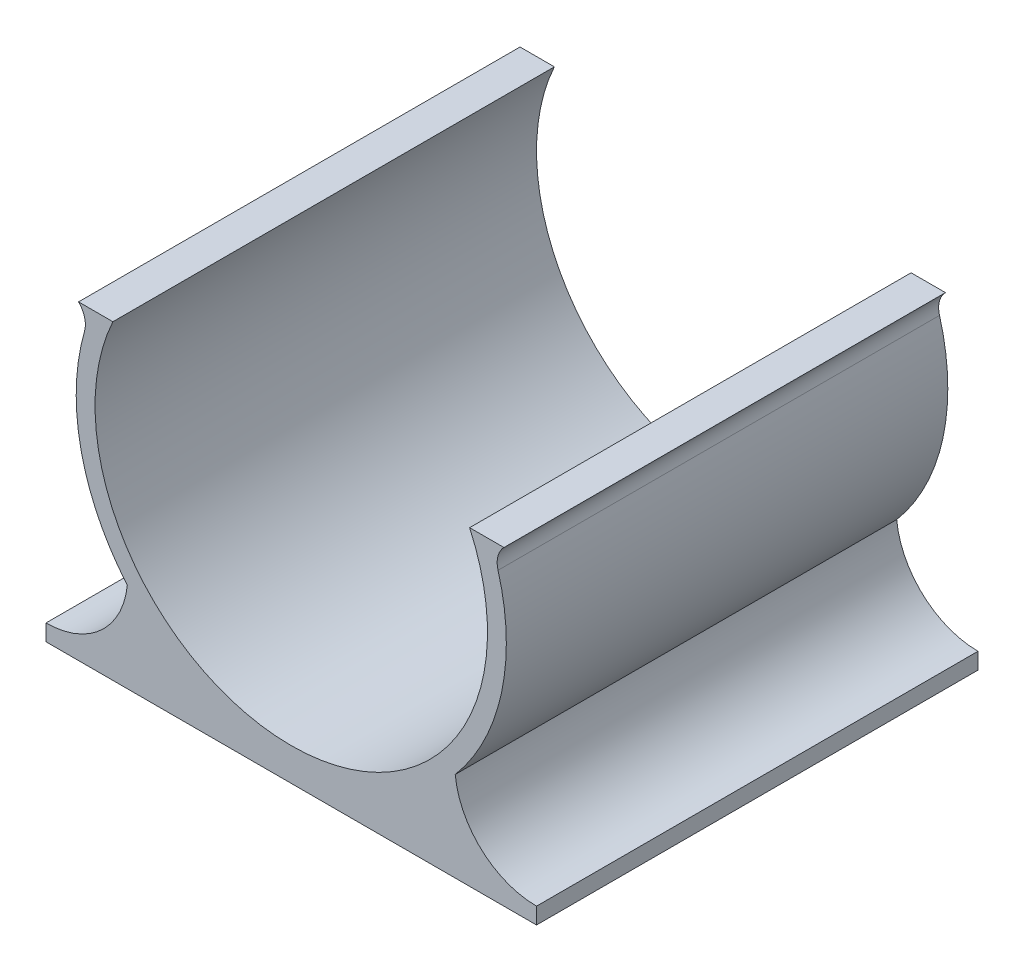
from build123d import *

# Parameters (mm, degrees)
SKETCH1_W          = 30
SKETCH1_H          = 27
EXTRUDE1_DEPTH     = 19
CUT_EXTRUDE1_REACH = 35.912
CUT_EXTRUDE2_REACH = 35.912
HOLE1_D            = 24


with BuildPart() as part:
    # Sketch1 → Extrude1 (new body)
    with BuildSketch(Plane.XZ.offset(14)):
        with Locations((0, 13.5)):
            Rectangle(SKETCH1_W, SKETCH1_H)
    extrude(amount=-EXTRUDE1_DEPTH)

    # Sketch2 → Cut-Extrude1 (cut, up to next)
    with BuildSketch(Plane(origin=(0, 0, 0), x_dir=(-1, 0, 0), z_dir=(0, 0, -1)), mode=Mode.PRIVATE) as cut_extrude1_sk1:
        with BuildLine():
            Line((-13.009839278, 5), (-15, 5))
            Line((-15, 5), (-15, -13))
            ThreePointArc((-15, -13), (-11.650754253, -11.712486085), (-10.026388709, -8.513021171))
            ThreePointArc((-10.026388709, -8.513021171), (-12.856192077, -2.778187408), (-12.646872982, 3.613392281))
            ThreePointArc((-12.646872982, 3.613392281), (-12.63859646, 4.356368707), (-13.009839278, 5))
        make_face()
    cut_extrude1_tool1 = extrude(cut_extrude1_sk1.sketch, amount=-CUT_EXTRUDE1_REACH, mode=Mode.PRIVATE) & part.part
    add(cut_extrude1_tool1.solids().sort_by_distance((13.373014, -5.247613, 0))[0], mode=Mode.SUBTRACT)

    # Sketch3 → Cut-Extrude2 (cut, up to next)
    with BuildSketch(Plane(origin=(0, 0, 0), x_dir=(-1, 0, 0), z_dir=(0, 0, -1)), mode=Mode.PRIVATE) as cut_extrude2_sk1:
        with BuildLine():
            Line((15, -13), (15, 5))
            Line((15, 5), (13.009839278, 5))
            ThreePointArc((13.009839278, 5), (12.63859646, 4.356368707), (12.646872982, 3.613392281))
            ThreePointArc((12.646872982, 3.613392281), (12.856192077, -2.778187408), (10.026388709, -8.513021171))
            ThreePointArc((10.026388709, -8.513021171), (11.650754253, -11.712486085), (15, -13))
        make_face()
    cut_extrude2_tool1 = extrude(cut_extrude2_sk1.sketch, amount=-CUT_EXTRUDE2_REACH, mode=Mode.PRIVATE) & part.part
    add(cut_extrude2_tool1.solids().sort_by_distance((-13.373014, -5.247613, 0))[0], mode=Mode.SUBTRACT)

    # Hole1 (through all)
    with Locations(Plane.XY.offset(27)):
        with Locations((0, 0)):
            Hole(HOLE1_D / 2)


solid = part.part
